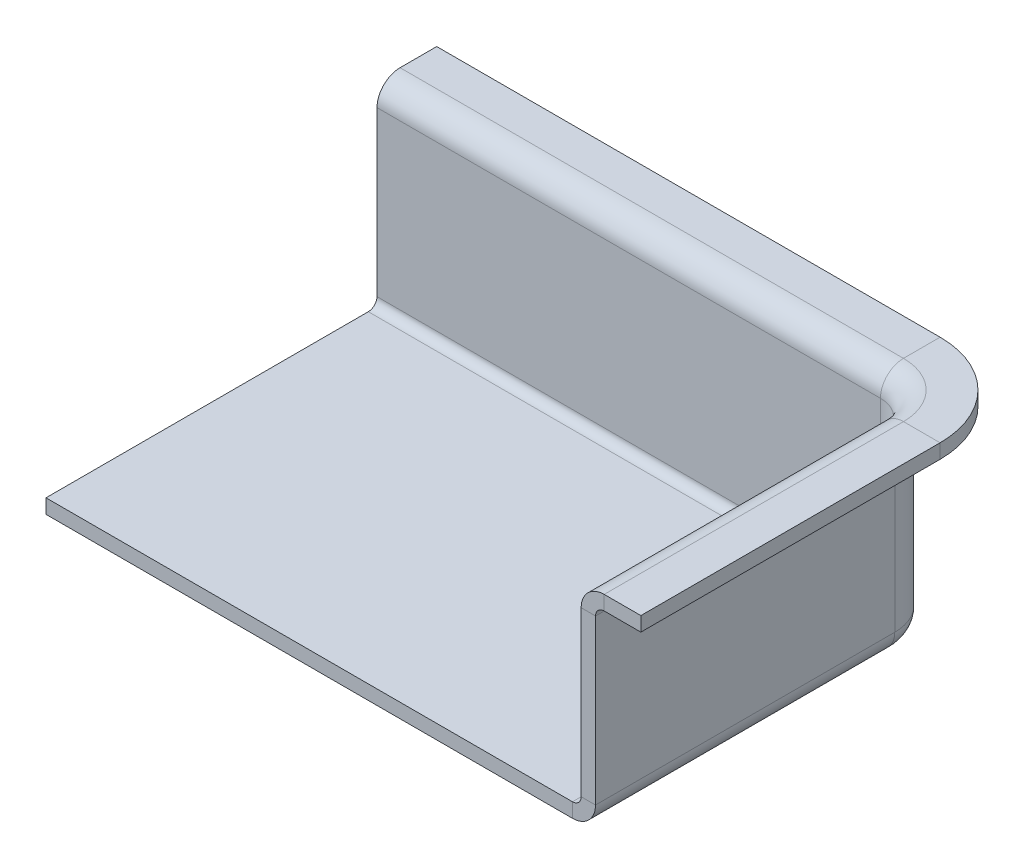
ISO-10303-21;
HEADER;
FILE_DESCRIPTION(('STEP AP214'),'2;1');
FILE_NAME('part.step','',(''),(''),'','','');
FILE_SCHEMA(('AUTOMOTIVE_DESIGN { 1 0 10303 214 1 1 1 1 }'));
ENDSEC;
DATA;
#1=APPLICATION_CONTEXT('core data for automotive mechanical design processes');
#2=APPLICATION_PROTOCOL_DEFINITION('international standard','automotive_design',2000,#1);
#3=PRODUCT_CONTEXT('',#1,'mechanical');
#4=PRODUCT('Part','Part','',(#3));
#5=PRODUCT_RELATED_PRODUCT_CATEGORY('part','',(#4));
#6=PRODUCT_DEFINITION_FORMATION('','',#4);
#7=PRODUCT_DEFINITION_CONTEXT('part definition',#1,'design');
#8=PRODUCT_DEFINITION('design','',#6,#7);
#9=PRODUCT_DEFINITION_SHAPE('','',#8);
#10=(LENGTH_UNIT() NAMED_UNIT(*) SI_UNIT(.MILLI.,.METRE.));
#11=(NAMED_UNIT(*) PLANE_ANGLE_UNIT() SI_UNIT($,.RADIAN.));
#12=(NAMED_UNIT(*) SI_UNIT($,.STERADIAN.) SOLID_ANGLE_UNIT());
#13=UNCERTAINTY_MEASURE_WITH_UNIT(LENGTH_MEASURE(1.E-05),#10,'distance_accuracy_value','');
#14=(GEOMETRIC_REPRESENTATION_CONTEXT(3) GLOBAL_UNCERTAINTY_ASSIGNED_CONTEXT((#13)) GLOBAL_UNIT_ASSIGNED_CONTEXT((#10,
#11,#12)) REPRESENTATION_CONTEXT('',''));
#15=CARTESIAN_POINT('',(0.,0.,0.));
#16=DIRECTION('',(0.,0.,1.));
#17=DIRECTION('',(1.,0.,0.));
#18=AXIS2_PLACEMENT_3D('',#15,#16,#17);
#19=CARTESIAN_POINT('',(-64.6141456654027,-3.302,-37.9563970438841));
#20=DIRECTION('',(-1.,0.,0.));
#21=DIRECTION('',(0.,0.,1.));
#22=AXIS2_PLACEMENT_3D('',#19,#20,#21);
#23=PLANE('',#22);
#24=DIRECTION('',(0.,0.,1.));
#25=VECTOR('',#24,1.);
#26=CARTESIAN_POINT('',(-64.6141456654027,0.,-37.9563970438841));
#27=LINE('',#26,#25);
#28=CARTESIAN_POINT('',(-64.6141456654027,0.,-32.6543970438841));
#29=VERTEX_POINT('',#28);
#30=CARTESIAN_POINT('',(-64.6141456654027,0.,41.4872246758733));
#31=VERTEX_POINT('',#30);
#32=EDGE_CURVE('E393',#29,#31,#27,.T.);
#33=ORIENTED_EDGE('',*,*,#32,.F.);
#34=DIRECTION('',(0.,1.,0.));
#35=VECTOR('',#34,1.);
#36=CARTESIAN_POINT('',(-64.6141456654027,-3.302,-32.6543970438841));
#37=LINE('',#36,#35);
#38=CARTESIAN_POINT('',(-64.6141456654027,-3.302,-32.6543970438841));
#39=VERTEX_POINT('',#38);
#40=EDGE_CURVE('E385',#39,#29,#37,.T.);
#41=ORIENTED_EDGE('',*,*,#40,.F.);
#42=DIRECTION('',(0.,0.,1.));
#43=VECTOR('',#42,1.);
#44=CARTESIAN_POINT('',(-64.6141456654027,-3.302,-37.9563970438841));
#45=LINE('',#44,#43);
#46=CARTESIAN_POINT('',(-64.6141456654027,-3.302,41.4872246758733));
#47=VERTEX_POINT('',#46);
#48=EDGE_CURVE('E57',#39,#47,#45,.T.);
#49=ORIENTED_EDGE('',*,*,#48,.T.);
#50=DIRECTION('',(0.,1.,0.));
#51=VECTOR('',#50,1.);
#52=CARTESIAN_POINT('',(-64.6141456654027,-3.302,41.4872246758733));
#53=LINE('',#52,#51);
#54=EDGE_CURVE('E12',#47,#31,#53,.T.);
#55=ORIENTED_EDGE('',*,*,#54,.T.);
#56=EDGE_LOOP('',(#33,#41,#49,#55));
#57=FACE_BOUND('',#56,.T.);
#58=ADVANCED_FACE('F35',(#57),#23,.T.);
#59=CARTESIAN_POINT('',(-64.6141456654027,-3.302,41.4872246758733));
#60=DIRECTION('',(0.,0.,1.));
#61=DIRECTION('',(1.,0.,0.));
#62=AXIS2_PLACEMENT_3D('',#59,#60,#61);
#63=PLANE('',#62);
#64=DIRECTION('',(0.,1.,0.));
#65=VECTOR('',#64,1.);
#66=CARTESIAN_POINT('',(56.4874835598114,-3.302,41.4872246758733));
#67=LINE('',#66,#65);
#68=CARTESIAN_POINT('',(56.4874835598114,-3.302,41.4872246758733));
#69=VERTEX_POINT('',#68);
#70=CARTESIAN_POINT('',(56.4874835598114,0.,41.4872246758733));
#71=VERTEX_POINT('',#70);
#72=EDGE_CURVE('E382',#69,#71,#67,.T.);
#73=ORIENTED_EDGE('',*,*,#72,.T.);
#74=DIRECTION('',(1.,0.,0.));
#75=VECTOR('',#74,1.);
#76=CARTESIAN_POINT('',(-64.6141456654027,0.,41.4872246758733));
#77=LINE('',#76,#75);
#78=EDGE_CURVE('E396',#31,#71,#77,.T.);
#79=ORIENTED_EDGE('',*,*,#78,.F.);
#80=ORIENTED_EDGE('',*,*,#54,.F.);
#81=DIRECTION('',(1.,0.,0.));
#82=VECTOR('',#81,1.);
#83=CARTESIAN_POINT('',(-64.6141456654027,-3.302,41.4872246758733));
#84=LINE('',#83,#82);
#85=EDGE_CURVE('E42',#47,#69,#84,.T.);
#86=ORIENTED_EDGE('',*,*,#85,.T.);
#87=EDGE_LOOP('',(#73,#79,#80,#86));
#88=FACE_BOUND('',#87,.T.);
#89=ADVANCED_FACE('F405',(#88),#63,.T.);
#90=CARTESIAN_POINT('',(0.,-3.302,0.));
#91=DIRECTION('',(0.,1.,0.));
#92=DIRECTION('',(0.,0.,1.));
#93=AXIS2_PLACEMENT_3D('',#90,#91,#92);
#94=PLANE('',#93);
#95=CARTESIAN_POINT('',(51.1854835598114,-3.302,-27.3523970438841));
#96=DIRECTION('',(0.,1.,0.));
#97=DIRECTION('',(1.,0.,0.));
#98=AXIS2_PLACEMENT_3D('',#95,#96,#97);
#99=CIRCLE('',#98,5.302);
#100=CARTESIAN_POINT('',(56.4874835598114,-3.302,-27.3523970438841));
#101=VERTEX_POINT('',#100);
#102=CARTESIAN_POINT('',(51.1854835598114,-3.302,-32.6543970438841));
#103=VERTEX_POINT('',#102);
#104=EDGE_CURVE('E303',#101,#103,#99,.T.);
#105=ORIENTED_EDGE('',*,*,#104,.F.);
#106=DIRECTION('',(0.,0.,-1.));
#107=VECTOR('',#106,1.);
#108=CARTESIAN_POINT('',(56.4874835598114,-3.302,41.4872246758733));
#109=LINE('',#108,#107);
#110=EDGE_CURVE('E293',#69,#101,#109,.T.);
#111=ORIENTED_EDGE('',*,*,#110,.F.);
#112=ORIENTED_EDGE('',*,*,#85,.F.);
#113=ORIENTED_EDGE('',*,*,#48,.F.);
#114=DIRECTION('',(-1.,0.,0.));
#115=VECTOR('',#114,1.);
#116=CARTESIAN_POINT('',(51.1854835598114,-3.302,-32.6543970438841));
#117=LINE('',#116,#115);
#118=EDGE_CURVE('E313',#103,#39,#117,.T.);
#119=ORIENTED_EDGE('',*,*,#118,.F.);
#120=EDGE_LOOP('',(#105,#111,#112,#113,#119));
#121=FACE_BOUND('',#120,.T.);
#122=ADVANCED_FACE('F418',(#121),#94,.F.);
#123=CARTESIAN_POINT('',(0.,0.,0.));
#124=DIRECTION('',(0.,1.,0.));
#125=DIRECTION('',(0.,0.,1.));
#126=AXIS2_PLACEMENT_3D('',#123,#124,#125);
#127=PLANE('',#126);
#128=DIRECTION('',(0.,0.,-1.));
#129=VECTOR('',#128,1.);
#130=CARTESIAN_POINT('',(56.4874835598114,0.,41.4872246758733));
#131=LINE('',#130,#129);
#132=CARTESIAN_POINT('',(56.4874835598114,0.,-27.3523970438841));
#133=VERTEX_POINT('',#132);
#134=EDGE_CURVE('E252',#71,#133,#131,.T.);
#135=ORIENTED_EDGE('',*,*,#134,.T.);
#136=CARTESIAN_POINT('',(51.1854835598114,0.,-27.3523970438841));
#137=DIRECTION('',(0.,1.,0.));
#138=DIRECTION('',(0.,0.,1.));
#139=AXIS2_PLACEMENT_3D('',#136,#137,#138);
#140=CIRCLE('',#139,5.302);
#141=CARTESIAN_POINT('',(51.1854835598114,0.,-32.6543970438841));
#142=VERTEX_POINT('',#141);
#143=EDGE_CURVE('E232',#133,#142,#140,.T.);
#144=ORIENTED_EDGE('',*,*,#143,.T.);
#145=DIRECTION('',(-1.,0.,0.));
#146=VECTOR('',#145,1.);
#147=CARTESIAN_POINT('',(51.1854835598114,0.,-32.6543970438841));
#148=LINE('',#147,#146);
#149=EDGE_CURVE('E257',#142,#29,#148,.T.);
#150=ORIENTED_EDGE('',*,*,#149,.T.);
#151=ORIENTED_EDGE('',*,*,#32,.T.);
#152=ORIENTED_EDGE('',*,*,#78,.T.);
#153=EDGE_LOOP('',(#135,#144,#150,#151,#152));
#154=FACE_BOUND('',#153,.T.);
#155=ADVANCED_FACE('F402',(#154),#127,.T.);
#156=CARTESIAN_POINT('',(-64.6141456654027,39.65704961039,-39.9563970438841));
#157=DIRECTION('',(-1.,0.,0.));
#158=DIRECTION('',(0.,0.,1.));
#159=AXIS2_PLACEMENT_3D('',#156,#157,#158);
#160=PLANE('',#159);
#161=DIRECTION('',(0.,1.,0.));
#162=VECTOR('',#161,1.);
#163=CARTESIAN_POINT('',(-64.6141456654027,41.65704961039,-39.9563970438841));
#164=LINE('',#163,#162);
#165=CARTESIAN_POINT('',(-64.6141456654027,41.65704961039,-39.9563970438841));
#166=VERTEX_POINT('',#165);
#167=CARTESIAN_POINT('',(-64.6141456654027,44.95904961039,-39.9563970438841));
#168=VERTEX_POINT('',#167);
#169=EDGE_CURVE('E391',#166,#168,#164,.T.);
#170=ORIENTED_EDGE('',*,*,#169,.F.);
#171=CARTESIAN_POINT('',(-64.6141456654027,39.65704961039,-39.9563970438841));
#172=DIRECTION('',(1.,0.,0.));
#173=DIRECTION('',(0.,0.,-1.));
#174=AXIS2_PLACEMENT_3D('',#171,#172,#173);
#175=CIRCLE('',#174,2.);
#176=CARTESIAN_POINT('',(-64.6141456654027,39.65704961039,-37.9563970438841));
#177=VERTEX_POINT('',#176);
#178=EDGE_CURVE('E337',#177,#166,#175,.F.);
#179=ORIENTED_EDGE('',*,*,#178,.F.);
#180=DIRECTION('',(0.,0.,1.));
#181=VECTOR('',#180,1.);
#182=CARTESIAN_POINT('',(-64.6141456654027,39.65704961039,-37.9563970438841));
#183=LINE('',#182,#181);
#184=CARTESIAN_POINT('',(-64.6141456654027,39.65704961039,-34.6543970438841));
#185=VERTEX_POINT('',#184);
#186=EDGE_CURVE('E389',#177,#185,#183,.T.);
#187=ORIENTED_EDGE('',*,*,#186,.T.);
#188=CARTESIAN_POINT('',(-64.6141456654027,39.65704961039,-39.9563970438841));
#189=DIRECTION('',(-1.,0.,0.));
#190=DIRECTION('',(0.,0.,1.));
#191=AXIS2_PLACEMENT_3D('',#188,#189,#190);
#192=CIRCLE('',#191,5.302);
#193=EDGE_CURVE('E191',#185,#168,#192,.T.);
#194=ORIENTED_EDGE('',*,*,#193,.T.);
#195=EDGE_LOOP('',(#170,#179,#187,#194));
#196=FACE_BOUND('',#195,.T.);
#197=ADVANCED_FACE('F490',(#196),#160,.T.);
#198=CARTESIAN_POINT('',(-64.6141456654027,-3.302,-37.9563970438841));
#199=DIRECTION('',(1.,0.,0.));
#200=DIRECTION('',(0.,1.,0.));
#201=AXIS2_PLACEMENT_3D('',#198,#199,#200);
#202=PLANE('',#201);
#203=ORIENTED_EDGE('',*,*,#186,.F.);
#204=DIRECTION('',(0.,1.,0.));
#205=VECTOR('',#204,1.);
#206=CARTESIAN_POINT('',(-64.6141456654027,-3.302,-37.9563970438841));
#207=LINE('',#206,#205);
#208=CARTESIAN_POINT('',(-64.6141456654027,2.,-37.9563970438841));
#209=VERTEX_POINT('',#208);
#210=EDGE_CURVE('E316',#209,#177,#207,.T.);
#211=ORIENTED_EDGE('',*,*,#210,.F.);
#212=DIRECTION('',(0.,0.,1.));
#213=VECTOR('',#212,1.);
#214=CARTESIAN_POINT('',(-64.6141456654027,2.,-37.9563970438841));
#215=LINE('',#214,#213);
#216=CARTESIAN_POINT('',(-64.6141456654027,2.,-34.6543970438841));
#217=VERTEX_POINT('',#216);
#218=EDGE_CURVE('E387',#209,#217,#215,.T.);
#219=ORIENTED_EDGE('',*,*,#218,.T.);
#220=DIRECTION('',(0.,1.,0.));
#221=VECTOR('',#220,1.);
#222=CARTESIAN_POINT('',(-64.6141456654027,-3.302,-34.6543970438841));
#223=LINE('',#222,#221);
#224=EDGE_CURVE('E225',#217,#185,#223,.T.);
#225=ORIENTED_EDGE('',*,*,#224,.T.);
#226=EDGE_LOOP('',(#203,#211,#219,#225));
#227=FACE_BOUND('',#226,.T.);
#228=ADVANCED_FACE('F492',(#227),#202,.F.);
#229=CARTESIAN_POINT('',(-64.6141456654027,2.,-32.6543970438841));
#230=DIRECTION('',(1.,0.,0.));
#231=DIRECTION('',(0.,0.,-1.));
#232=AXIS2_PLACEMENT_3D('',#229,#230,#231);
#233=PLANE('',#232);
#234=ORIENTED_EDGE('',*,*,#218,.F.);
#235=CARTESIAN_POINT('',(-64.6141456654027,2.,-32.6543970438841));
#236=DIRECTION('',(-1.,0.,0.));
#237=DIRECTION('',(0.,0.,1.));
#238=AXIS2_PLACEMENT_3D('',#235,#236,#237);
#239=CIRCLE('',#238,5.302);
#240=EDGE_CURVE('E309',#39,#209,#239,.F.);
#241=ORIENTED_EDGE('',*,*,#240,.F.);
#242=ORIENTED_EDGE('',*,*,#40,.T.);
#243=CARTESIAN_POINT('',(-64.6141456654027,2.,-32.6543970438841));
#244=DIRECTION('',(-1.,0.,0.));
#245=DIRECTION('',(0.,0.,1.));
#246=AXIS2_PLACEMENT_3D('',#243,#244,#245);
#247=CIRCLE('',#246,2.);
#248=EDGE_CURVE('E226',#29,#217,#247,.F.);
#249=ORIENTED_EDGE('',*,*,#248,.T.);
#250=EDGE_LOOP('',(#234,#241,#242,#249));
#251=FACE_BOUND('',#250,.T.);
#252=ADVANCED_FACE('F447',(#251),#233,.F.);
#253=CARTESIAN_POINT('',(56.4874835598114,2.,41.4872246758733));
#254=DIRECTION('',(0.,0.,1.));
#255=DIRECTION('',(1.,0.,0.));
#256=AXIS2_PLACEMENT_3D('',#253,#254,#255);
#257=PLANE('',#256);
#258=ORIENTED_EDGE('',*,*,#72,.F.);
#259=CARTESIAN_POINT('',(56.4874835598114,2.,41.4872246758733));
#260=DIRECTION('',(0.,0.,-1.));
#261=DIRECTION('',(-1.,0.,0.));
#262=AXIS2_PLACEMENT_3D('',#259,#260,#261);
#263=CIRCLE('',#262,5.302);
#264=CARTESIAN_POINT('',(61.7894835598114,2.,41.4872246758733));
#265=VERTEX_POINT('',#264);
#266=EDGE_CURVE('E285',#69,#265,#263,.F.);
#267=ORIENTED_EDGE('',*,*,#266,.T.);
#268=DIRECTION('',(-1.,0.,0.));
#269=VECTOR('',#268,1.);
#270=CARTESIAN_POINT('',(61.7894835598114,2.,41.4872246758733));
#271=LINE('',#270,#269);
#272=CARTESIAN_POINT('',(58.4874835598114,2.,41.4872246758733));
#273=VERTEX_POINT('',#272);
#274=EDGE_CURVE('E380',#265,#273,#271,.T.);
#275=ORIENTED_EDGE('',*,*,#274,.T.);
#276=CARTESIAN_POINT('',(56.4874835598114,2.,41.4872246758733));
#277=DIRECTION('',(0.,0.,-1.));
#278=DIRECTION('',(-1.,0.,0.));
#279=AXIS2_PLACEMENT_3D('',#276,#277,#278);
#280=CIRCLE('',#279,2.);
#281=EDGE_CURVE('E269',#71,#273,#280,.F.);
#282=ORIENTED_EDGE('',*,*,#281,.F.);
#283=EDGE_LOOP('',(#258,#267,#275,#282));
#284=FACE_BOUND('',#283,.T.);
#285=ADVANCED_FACE('F410',(#284),#257,.T.);
#286=CARTESIAN_POINT('',(61.7894835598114,-3.302,41.4872246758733));
#287=DIRECTION('',(0.,0.,1.));
#288=DIRECTION('',(0.,1.,0.));
#289=AXIS2_PLACEMENT_3D('',#286,#287,#288);
#290=PLANE('',#289);
#291=ORIENTED_EDGE('',*,*,#274,.F.);
#292=DIRECTION('',(0.,1.,0.));
#293=VECTOR('',#292,1.);
#294=CARTESIAN_POINT('',(61.7894835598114,-3.302,41.4872246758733));
#295=LINE('',#294,#293);
#296=CARTESIAN_POINT('',(61.7894835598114,39.65704961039,41.4872246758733));
#297=VERTEX_POINT('',#296);
#298=EDGE_CURVE('E288',#265,#297,#295,.T.);
#299=ORIENTED_EDGE('',*,*,#298,.T.);
#300=DIRECTION('',(-1.,0.,0.));
#301=VECTOR('',#300,1.);
#302=CARTESIAN_POINT('',(61.7894835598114,39.65704961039,41.4872246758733));
#303=LINE('',#302,#301);
#304=CARTESIAN_POINT('',(58.4874835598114,39.65704961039,41.4872246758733));
#305=VERTEX_POINT('',#304);
#306=EDGE_CURVE('E378',#297,#305,#303,.T.);
#307=ORIENTED_EDGE('',*,*,#306,.T.);
#308=DIRECTION('',(0.,1.,0.));
#309=VECTOR('',#308,1.);
#310=CARTESIAN_POINT('',(58.4874835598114,-3.302,41.4872246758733));
#311=LINE('',#310,#309);
#312=EDGE_CURVE('E266',#273,#305,#311,.T.);
#313=ORIENTED_EDGE('',*,*,#312,.F.);
#314=EDGE_LOOP('',(#291,#299,#307,#313));
#315=FACE_BOUND('',#314,.T.);
#316=ADVANCED_FACE('F434',(#315),#290,.T.);
#317=CARTESIAN_POINT('',(63.7894835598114,39.65704961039,41.4872246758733));
#318=DIRECTION('',(0.,0.,-1.));
#319=DIRECTION('',(-1.,0.,0.));
#320=AXIS2_PLACEMENT_3D('',#317,#318,#319);
#321=PLANE('',#320);
#322=ORIENTED_EDGE('',*,*,#306,.F.);
#323=CARTESIAN_POINT('',(63.7894835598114,39.65704961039,41.4872246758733));
#324=DIRECTION('',(0.,0.,1.));
#325=DIRECTION('',(1.,0.,0.));
#326=AXIS2_PLACEMENT_3D('',#323,#324,#325);
#327=CIRCLE('',#326,2.);
#328=CARTESIAN_POINT('',(63.7894835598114,41.65704961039,41.4872246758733));
#329=VERTEX_POINT('',#328);
#330=EDGE_CURVE('E321',#297,#329,#327,.F.);
#331=ORIENTED_EDGE('',*,*,#330,.T.);
#332=DIRECTION('',(0.,1.,0.));
#333=VECTOR('',#332,1.);
#334=CARTESIAN_POINT('',(63.7894835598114,41.65704961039,41.4872246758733));
#335=LINE('',#334,#333);
#336=CARTESIAN_POINT('',(63.7894835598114,44.95904961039,41.4872246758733));
#337=VERTEX_POINT('',#336);
#338=EDGE_CURVE('E376',#329,#337,#335,.T.);
#339=ORIENTED_EDGE('',*,*,#338,.T.);
#340=CARTESIAN_POINT('',(63.7894835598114,39.65704961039,41.4872246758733));
#341=DIRECTION('',(0.,0.,-1.));
#342=DIRECTION('',(-1.,0.,0.));
#343=AXIS2_PLACEMENT_3D('',#340,#341,#342);
#344=CIRCLE('',#343,5.302);
#345=EDGE_CURVE('E263',#305,#337,#344,.T.);
#346=ORIENTED_EDGE('',*,*,#345,.F.);
#347=EDGE_LOOP('',(#322,#331,#339,#346));
#348=FACE_BOUND('',#347,.T.);
#349=ADVANCED_FACE('F462',(#348),#321,.F.);
#350=CARTESIAN_POINT('',(61.7894835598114,41.65704961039,41.4872246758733));
#351=DIRECTION('',(0.,0.,1.));
#352=DIRECTION('',(1.,0.,0.));
#353=AXIS2_PLACEMENT_3D('',#350,#351,#352);
#354=PLANE('',#353);
#355=ORIENTED_EDGE('',*,*,#338,.F.);
#356=DIRECTION('',(1.,0.,0.));
#357=VECTOR('',#356,1.);
#358=CARTESIAN_POINT('',(61.7894835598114,41.65704961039,41.4872246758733));
#359=LINE('',#358,#357);
#360=CARTESIAN_POINT('',(72.2210418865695,41.65704961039,41.4872246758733));
#361=VERTEX_POINT('',#360);
#362=EDGE_CURVE('E298',#329,#361,#359,.T.);
#363=ORIENTED_EDGE('',*,*,#362,.T.);
#364=DIRECTION('',(0.,1.,0.));
#365=VECTOR('',#364,1.);
#366=CARTESIAN_POINT('',(72.2210418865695,41.65704961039,41.4872246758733));
#367=LINE('',#366,#365);
#368=CARTESIAN_POINT('',(72.2210418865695,44.95904961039,41.4872246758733));
#369=VERTEX_POINT('',#368);
#370=EDGE_CURVE('E374',#361,#369,#367,.T.);
#371=ORIENTED_EDGE('',*,*,#370,.T.);
#372=DIRECTION('',(1.,0.,0.));
#373=VECTOR('',#372,1.);
#374=CARTESIAN_POINT('',(61.7894835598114,44.95904961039,41.4872246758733));
#375=LINE('',#374,#373);
#376=EDGE_CURVE('E260',#337,#369,#375,.T.);
#377=ORIENTED_EDGE('',*,*,#376,.F.);
#378=EDGE_LOOP('',(#355,#363,#371,#377));
#379=FACE_BOUND('',#378,.T.);
#380=ADVANCED_FACE('F465',(#379),#354,.T.);
#381=CARTESIAN_POINT('',(72.2210418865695,41.65704961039,41.4872246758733));
#382=DIRECTION('',(1.,0.,0.));
#383=DIRECTION('',(0.,0.,-1.));
#384=AXIS2_PLACEMENT_3D('',#381,#382,#383);
#385=PLANE('',#384);
#386=ORIENTED_EDGE('',*,*,#370,.F.);
#387=DIRECTION('',(0.,0.,-1.));
#388=VECTOR('',#387,1.);
#389=CARTESIAN_POINT('',(72.2210418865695,41.65704961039,41.4872246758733));
#390=LINE('',#389,#388);
#391=CARTESIAN_POINT('',(72.2210418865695,41.65704961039,-27.3523970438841));
#392=VERTEX_POINT('',#391);
#393=EDGE_CURVE('E308',#361,#392,#390,.T.);
#394=ORIENTED_EDGE('',*,*,#393,.T.);
#395=DIRECTION('',(0.,1.,0.));
#396=VECTOR('',#395,1.);
#397=CARTESIAN_POINT('',(72.2210418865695,41.65704961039,-27.3523970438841));
#398=LINE('',#397,#396);
#399=CARTESIAN_POINT('',(72.2210418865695,44.95904961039,-27.3523970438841));
#400=VERTEX_POINT('',#399);
#401=EDGE_CURVE('E372',#392,#400,#398,.T.);
#402=ORIENTED_EDGE('',*,*,#401,.T.);
#403=DIRECTION('',(0.,0.,1.));
#404=VECTOR('',#403,1.);
#405=CARTESIAN_POINT('',(72.2210418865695,44.95904961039,41.4872246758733));
#406=LINE('',#405,#404);
#407=EDGE_CURVE('E245',#369,#400,#406,.F.);
#408=ORIENTED_EDGE('',*,*,#407,.F.);
#409=EDGE_LOOP('',(#386,#394,#402,#408));
#410=FACE_BOUND('',#409,.T.);
#411=ADVANCED_FACE('F539',(#410),#385,.T.);
#412=CARTESIAN_POINT('',(51.1854835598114,41.65704961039,-27.3523970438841));
#413=DIRECTION('',(0.,1.,0.));
#414=DIRECTION('',(0.,0.,1.));
#415=AXIS2_PLACEMENT_3D('',#412,#413,#414);
#416=CYLINDRICAL_SURFACE('',#415,21.0355583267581);
#417=ORIENTED_EDGE('',*,*,#401,.F.);
#418=CARTESIAN_POINT('',(51.1854835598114,41.65704961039,-27.3523970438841));
#419=DIRECTION('',(0.,1.,0.));
#420=DIRECTION('',(1.,0.,0.));
#421=AXIS2_PLACEMENT_3D('',#418,#419,#420);
#422=CIRCLE('',#421,21.0355583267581);
#423=CARTESIAN_POINT('',(51.1854835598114,41.65704961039,-48.3879553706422));
#424=VERTEX_POINT('',#423);
#425=EDGE_CURVE('E318',#392,#424,#422,.T.);
#426=ORIENTED_EDGE('',*,*,#425,.T.);
#427=DIRECTION('',(0.,1.,0.));
#428=VECTOR('',#427,1.);
#429=CARTESIAN_POINT('',(51.1854835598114,41.65704961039,-48.3879553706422));
#430=LINE('',#429,#428);
#431=CARTESIAN_POINT('',(51.1854835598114,44.95904961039,-48.3879553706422));
#432=VERTEX_POINT('',#431);
#433=EDGE_CURVE('E370',#424,#432,#430,.T.);
#434=ORIENTED_EDGE('',*,*,#433,.T.);
#435=CARTESIAN_POINT('',(51.1854835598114,44.95904961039,-27.3523970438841));
#436=DIRECTION('',(0.,1.,0.));
#437=DIRECTION('',(0.,0.,1.));
#438=AXIS2_PLACEMENT_3D('',#435,#436,#437);
#439=CIRCLE('',#438,21.0355583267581);
#440=EDGE_CURVE('E201',#400,#432,#439,.T.);
#441=ORIENTED_EDGE('',*,*,#440,.F.);
#442=EDGE_LOOP('',(#417,#426,#434,#441));
#443=FACE_BOUND('',#442,.T.);
#444=ADVANCED_FACE('F472',(#443),#416,.T.);
#445=CARTESIAN_POINT('',(51.1854835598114,41.65704961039,-48.3879553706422));
#446=DIRECTION('',(0.,0.,-1.));
#447=DIRECTION('',(-1.,0.,0.));
#448=AXIS2_PLACEMENT_3D('',#445,#446,#447);
#449=PLANE('',#448);
#450=ORIENTED_EDGE('',*,*,#433,.F.);
#451=DIRECTION('',(-1.,0.,0.));
#452=VECTOR('',#451,1.);
#453=CARTESIAN_POINT('',(51.1854835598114,41.65704961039,-48.3879553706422));
#454=LINE('',#453,#452);
#455=CARTESIAN_POINT('',(-64.6141456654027,41.65704961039,-48.3879553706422));
#456=VERTEX_POINT('',#455);
#457=EDGE_CURVE('E272',#424,#456,#454,.T.);
#458=ORIENTED_EDGE('',*,*,#457,.T.);
#459=DIRECTION('',(0.,1.,0.));
#460=VECTOR('',#459,1.);
#461=CARTESIAN_POINT('',(-64.6141456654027,41.65704961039,-48.3879553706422));
#462=LINE('',#461,#460);
#463=CARTESIAN_POINT('',(-64.6141456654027,44.95904961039,-48.3879553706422));
#464=VERTEX_POINT('',#463);
#465=EDGE_CURVE('E255',#456,#464,#462,.T.);
#466=ORIENTED_EDGE('',*,*,#465,.T.);
#467=DIRECTION('',(1.,0.,0.));
#468=VECTOR('',#467,1.);
#469=CARTESIAN_POINT('',(51.1854835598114,44.95904961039,-48.3879553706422));
#470=LINE('',#469,#468);
#471=EDGE_CURVE('E253',#432,#464,#470,.F.);
#472=ORIENTED_EDGE('',*,*,#471,.F.);
#473=EDGE_LOOP('',(#450,#458,#466,#472));
#474=FACE_BOUND('',#473,.T.);
#475=ADVANCED_FACE('F476',(#474),#449,.T.);
#476=CARTESIAN_POINT('',(-64.6141456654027,41.65704961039,-37.9563970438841));
#477=DIRECTION('',(1.,0.,0.));
#478=DIRECTION('',(0.,0.,-1.));
#479=AXIS2_PLACEMENT_3D('',#476,#477,#478);
#480=PLANE('',#479);
#481=DIRECTION('',(0.,0.,-1.));
#482=VECTOR('',#481,1.);
#483=CARTESIAN_POINT('',(-64.6141456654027,41.65704961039,-37.9563970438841));
#484=LINE('',#483,#482);
#485=EDGE_CURVE('E355',#166,#456,#484,.T.);
#486=ORIENTED_EDGE('',*,*,#485,.F.);
#487=ORIENTED_EDGE('',*,*,#169,.T.);
#488=DIRECTION('',(0.,0.,1.));
#489=VECTOR('',#488,1.);
#490=CARTESIAN_POINT('',(-64.6141456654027,44.95904961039,-37.9563970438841));
#491=LINE('',#490,#489);
#492=EDGE_CURVE('E186',#168,#464,#491,.F.);
#493=ORIENTED_EDGE('',*,*,#492,.T.);
#494=ORIENTED_EDGE('',*,*,#465,.F.);
#495=EDGE_LOOP('',(#486,#487,#493,#494));
#496=FACE_BOUND('',#495,.T.);
#497=ADVANCED_FACE('F487',(#496),#480,.F.);
#498=CARTESIAN_POINT('',(51.1854835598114,44.95904961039,-37.9563970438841));
#499=DIRECTION('',(0.,1.,0.));
#500=DIRECTION('',(0.,0.,1.));
#501=AXIS2_PLACEMENT_3D('',#498,#499,#500);
#502=PLANE('',#501);
#503=ORIENTED_EDGE('',*,*,#471,.T.);
#504=ORIENTED_EDGE('',*,*,#492,.F.);
#505=DIRECTION('',(-1.,0.,0.));
#506=VECTOR('',#505,1.);
#507=CARTESIAN_POINT('',(51.1854835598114,44.95904961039,-39.9563970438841));
#508=LINE('',#507,#506);
#509=CARTESIAN_POINT('',(51.1854835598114,44.95904961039,-39.9563970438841));
#510=VERTEX_POINT('',#509);
#511=EDGE_CURVE('E180',#510,#168,#508,.T.);
#512=ORIENTED_EDGE('',*,*,#511,.F.);
#513=DIRECTION('',(0.,0.,1.));
#514=VECTOR('',#513,1.);
#515=CARTESIAN_POINT('',(51.1854835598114,44.95904961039,-37.9563970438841));
#516=LINE('',#515,#514);
#517=EDGE_CURVE('E184',#510,#432,#516,.F.);
#518=ORIENTED_EDGE('',*,*,#517,.T.);
#519=EDGE_LOOP('',(#503,#504,#512,#518));
#520=FACE_BOUND('',#519,.T.);
#521=ADVANCED_FACE('F183',(#520),#502,.T.);
#522=CARTESIAN_POINT('',(51.1854835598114,39.65704961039,-39.9563970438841));
#523=DIRECTION('',(-1.,0.,0.));
#524=DIRECTION('',(0.,0.,1.));
#525=AXIS2_PLACEMENT_3D('',#522,#523,#524);
#526=CYLINDRICAL_SURFACE('',#525,5.302);
#527=ORIENTED_EDGE('',*,*,#511,.T.);
#528=ORIENTED_EDGE('',*,*,#193,.F.);
#529=DIRECTION('',(1.,0.,0.));
#530=VECTOR('',#529,1.);
#531=CARTESIAN_POINT('',(51.1854835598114,39.65704961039,-34.6543970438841));
#532=LINE('',#531,#530);
#533=CARTESIAN_POINT('',(51.1854835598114,39.65704961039,-34.6543970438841));
#534=VERTEX_POINT('',#533);
#535=EDGE_CURVE('E215',#534,#185,#532,.F.);
#536=ORIENTED_EDGE('',*,*,#535,.F.);
#537=CARTESIAN_POINT('',(51.1854835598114,39.65704961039,-39.9563970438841));
#538=DIRECTION('',(-1.,0.,0.));
#539=DIRECTION('',(0.,0.,1.));
#540=AXIS2_PLACEMENT_3D('',#537,#538,#539);
#541=CIRCLE('',#540,5.302);
#542=EDGE_CURVE('E208',#534,#510,#541,.T.);
#543=ORIENTED_EDGE('',*,*,#542,.T.);
#544=EDGE_LOOP('',(#527,#528,#536,#543));
#545=FACE_BOUND('',#544,.T.);
#546=ADVANCED_FACE('F213',(#545),#526,.T.);
#547=CARTESIAN_POINT('',(51.1854835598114,-3.302,-34.6543970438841));
#548=DIRECTION('',(0.,0.,1.));
#549=DIRECTION('',(1.,0.,0.));
#550=AXIS2_PLACEMENT_3D('',#547,#548,#549);
#551=PLANE('',#550);
#552=ORIENTED_EDGE('',*,*,#535,.T.);
#553=ORIENTED_EDGE('',*,*,#224,.F.);
#554=DIRECTION('',(-1.,0.,0.));
#555=VECTOR('',#554,1.);
#556=CARTESIAN_POINT('',(51.1854835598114,2.,-34.6543970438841));
#557=LINE('',#556,#555);
#558=CARTESIAN_POINT('',(51.1854835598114,2.,-34.6543970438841));
#559=VERTEX_POINT('',#558);
#560=EDGE_CURVE('E222',#559,#217,#557,.T.);
#561=ORIENTED_EDGE('',*,*,#560,.F.);
#562=DIRECTION('',(0.,1.,0.));
#563=VECTOR('',#562,1.);
#564=CARTESIAN_POINT('',(51.1854835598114,-3.302,-34.6543970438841));
#565=LINE('',#564,#563);
#566=EDGE_CURVE('E218',#559,#534,#565,.T.);
#567=ORIENTED_EDGE('',*,*,#566,.T.);
#568=EDGE_LOOP('',(#552,#553,#561,#567));
#569=FACE_BOUND('',#568,.T.);
#570=ADVANCED_FACE('F452',(#569),#551,.T.);
#571=CARTESIAN_POINT('',(51.1854835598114,2.,-32.6543970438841));
#572=DIRECTION('',(-1.,0.,0.));
#573=DIRECTION('',(0.,0.,1.));
#574=AXIS2_PLACEMENT_3D('',#571,#572,#573);
#575=CYLINDRICAL_SURFACE('',#574,2.);
#576=ORIENTED_EDGE('',*,*,#560,.T.);
#577=ORIENTED_EDGE('',*,*,#248,.F.);
#578=ORIENTED_EDGE('',*,*,#149,.F.);
#579=CARTESIAN_POINT('',(51.1854835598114,2.,-32.6543970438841));
#580=DIRECTION('',(-1.,0.,0.));
#581=DIRECTION('',(0.,0.,1.));
#582=AXIS2_PLACEMENT_3D('',#579,#580,#581);
#583=CIRCLE('',#582,2.);
#584=EDGE_CURVE('E230',#142,#559,#583,.F.);
#585=ORIENTED_EDGE('',*,*,#584,.T.);
#586=EDGE_LOOP('',(#576,#577,#578,#585));
#587=FACE_BOUND('',#586,.T.);
#588=ADVANCED_FACE('F448',(#587),#575,.F.);
#589=CARTESIAN_POINT('',(61.7894835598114,44.95904961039,-27.3523970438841));
#590=DIRECTION('',(0.,1.,0.));
#591=DIRECTION('',(0.,0.,1.));
#592=AXIS2_PLACEMENT_3D('',#589,#590,#591);
#593=PLANE('',#592);
#594=ORIENTED_EDGE('',*,*,#440,.T.);
#595=ORIENTED_EDGE('',*,*,#517,.F.);
#596=CARTESIAN_POINT('',(51.1854835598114,44.95904961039,-27.3523970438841));
#597=DIRECTION('',(0.,1.,0.));
#598=DIRECTION('',(0.,0.,1.));
#599=AXIS2_PLACEMENT_3D('',#596,#597,#598);
#600=CIRCLE('',#599,12.604);
#601=CARTESIAN_POINT('',(63.7894835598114,44.95904961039,-27.3523970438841));
#602=VERTEX_POINT('',#601);
#603=EDGE_CURVE('E198',#602,#510,#600,.T.);
#604=ORIENTED_EDGE('',*,*,#603,.F.);
#605=DIRECTION('',(1.,0.,0.));
#606=VECTOR('',#605,1.);
#607=CARTESIAN_POINT('',(61.7894835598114,44.95904961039,-27.3523970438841));
#608=LINE('',#607,#606);
#609=EDGE_CURVE('E243',#602,#400,#608,.T.);
#610=ORIENTED_EDGE('',*,*,#609,.T.);
#611=EDGE_LOOP('',(#594,#595,#604,#610));
#612=FACE_BOUND('',#611,.T.);
#613=ADVANCED_FACE('F196',(#612),#593,.T.);
#614=CARTESIAN_POINT('',(51.1854835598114,39.65704961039,-27.3523970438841));
#615=DIRECTION('',(0.,1.,0.));
#616=DIRECTION('',(0.,0.,1.));
#617=AXIS2_PLACEMENT_3D('',#614,#615,#616);
#618=TOROIDAL_SURFACE('',#617,12.604,5.302);
#619=ORIENTED_EDGE('',*,*,#603,.T.);
#620=ORIENTED_EDGE('',*,*,#542,.F.);
#621=CARTESIAN_POINT('',(51.1854835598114,39.65704961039,-27.3523970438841));
#622=DIRECTION('',(0.,1.,0.));
#623=DIRECTION('',(0.,0.,1.));
#624=AXIS2_PLACEMENT_3D('',#621,#622,#623);
#625=CIRCLE('',#624,7.302);
#626=CARTESIAN_POINT('',(58.4874835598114,39.65704961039,-27.3523970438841));
#627=VERTEX_POINT('',#626);
#628=EDGE_CURVE('E216',#627,#534,#625,.T.);
#629=ORIENTED_EDGE('',*,*,#628,.F.);
#630=CARTESIAN_POINT('',(63.7894835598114,39.65704961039,-27.3523970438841));
#631=DIRECTION('',(0.,0.,1.));
#632=DIRECTION('',(1.,0.,0.));
#633=AXIS2_PLACEMENT_3D('',#630,#631,#632);
#634=CIRCLE('',#633,5.302);
#635=EDGE_CURVE('E211',#627,#602,#634,.F.);
#636=ORIENTED_EDGE('',*,*,#635,.T.);
#637=EDGE_LOOP('',(#619,#620,#629,#636));
#638=FACE_BOUND('',#637,.T.);
#639=ADVANCED_FACE('F207',(#638),#618,.T.);
#640=CARTESIAN_POINT('',(51.1854835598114,0.,-27.3523970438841));
#641=DIRECTION('',(0.,1.,0.));
#642=DIRECTION('',(0.,0.,1.));
#643=AXIS2_PLACEMENT_3D('',#640,#641,#642);
#644=CYLINDRICAL_SURFACE('',#643,7.302);
#645=ORIENTED_EDGE('',*,*,#628,.T.);
#646=ORIENTED_EDGE('',*,*,#566,.F.);
#647=CARTESIAN_POINT('',(51.1854835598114,2.,-27.3523970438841));
#648=DIRECTION('',(0.,1.,0.));
#649=DIRECTION('',(0.,0.,1.));
#650=AXIS2_PLACEMENT_3D('',#647,#648,#649);
#651=CIRCLE('',#650,7.302);
#652=CARTESIAN_POINT('',(58.4874835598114,2.,-27.3523970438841));
#653=VERTEX_POINT('',#652);
#654=EDGE_CURVE('E229',#653,#559,#651,.T.);
#655=ORIENTED_EDGE('',*,*,#654,.F.);
#656=DIRECTION('',(0.,1.,0.));
#657=VECTOR('',#656,1.);
#658=CARTESIAN_POINT('',(58.4874835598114,0.,-27.3523970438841));
#659=LINE('',#658,#657);
#660=EDGE_CURVE('E236',#653,#627,#659,.T.);
#661=ORIENTED_EDGE('',*,*,#660,.T.);
#662=EDGE_LOOP('',(#645,#646,#655,#661));
#663=FACE_BOUND('',#662,.T.);
#664=ADVANCED_FACE('F454',(#663),#644,.F.);
#665=CARTESIAN_POINT('',(51.1854835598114,2.,-27.3523970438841));
#666=DIRECTION('',(0.,1.,0.));
#667=DIRECTION('',(0.,0.,1.));
#668=AXIS2_PLACEMENT_3D('',#665,#666,#667);
#669=TOROIDAL_SURFACE('',#668,5.302,2.);
#670=ORIENTED_EDGE('',*,*,#654,.T.);
#671=ORIENTED_EDGE('',*,*,#584,.F.);
#672=ORIENTED_EDGE('',*,*,#143,.F.);
#673=CARTESIAN_POINT('',(56.4874835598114,2.,-27.3523970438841));
#674=DIRECTION('',(0.,0.,1.));
#675=DIRECTION('',(1.,0.,0.));
#676=AXIS2_PLACEMENT_3D('',#673,#674,#675);
#677=CIRCLE('',#676,2.);
#678=EDGE_CURVE('E49',#133,#653,#677,.T.);
#679=ORIENTED_EDGE('',*,*,#678,.T.);
#680=EDGE_LOOP('',(#670,#671,#672,#679));
#681=FACE_BOUND('',#680,.T.);
#682=ADVANCED_FACE('F441',(#681),#669,.F.);
#683=CARTESIAN_POINT('',(61.7894835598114,44.95904961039,41.4872246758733));
#684=DIRECTION('',(0.,1.,0.));
#685=DIRECTION('',(0.,0.,1.));
#686=AXIS2_PLACEMENT_3D('',#683,#684,#685);
#687=PLANE('',#686);
#688=ORIENTED_EDGE('',*,*,#407,.T.);
#689=ORIENTED_EDGE('',*,*,#609,.F.);
#690=DIRECTION('',(0.,0.,-1.));
#691=VECTOR('',#690,1.);
#692=CARTESIAN_POINT('',(63.7894835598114,44.95904961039,41.4872246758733));
#693=LINE('',#692,#691);
#694=EDGE_CURVE('E242',#337,#602,#693,.T.);
#695=ORIENTED_EDGE('',*,*,#694,.F.);
#696=ORIENTED_EDGE('',*,*,#376,.T.);
#697=EDGE_LOOP('',(#688,#689,#695,#696));
#698=FACE_BOUND('',#697,.T.);
#699=ADVANCED_FACE('F469',(#698),#687,.T.);
#700=CARTESIAN_POINT('',(63.7894835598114,39.65704961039,41.4872246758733));
#701=DIRECTION('',(0.,0.,-1.));
#702=DIRECTION('',(-1.,0.,0.));
#703=AXIS2_PLACEMENT_3D('',#700,#701,#702);
#704=CYLINDRICAL_SURFACE('',#703,5.302);
#705=ORIENTED_EDGE('',*,*,#694,.T.);
#706=ORIENTED_EDGE('',*,*,#635,.F.);
#707=DIRECTION('',(0.,0.,1.));
#708=VECTOR('',#707,1.);
#709=CARTESIAN_POINT('',(58.4874835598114,39.65704961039,41.4872246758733));
#710=LINE('',#709,#708);
#711=EDGE_CURVE('E238',#305,#627,#710,.F.);
#712=ORIENTED_EDGE('',*,*,#711,.F.);
#713=ORIENTED_EDGE('',*,*,#345,.T.);
#714=EDGE_LOOP('',(#705,#706,#712,#713));
#715=FACE_BOUND('',#714,.T.);
#716=ADVANCED_FACE('F457',(#715),#704,.T.);
#717=CARTESIAN_POINT('',(58.4874835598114,-3.302,41.4872246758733));
#718=DIRECTION('',(-1.,0.,0.));
#719=DIRECTION('',(0.,0.,1.));
#720=AXIS2_PLACEMENT_3D('',#717,#718,#719);
#721=PLANE('',#720);
#722=ORIENTED_EDGE('',*,*,#711,.T.);
#723=ORIENTED_EDGE('',*,*,#660,.F.);
#724=DIRECTION('',(0.,0.,-1.));
#725=VECTOR('',#724,1.);
#726=CARTESIAN_POINT('',(58.4874835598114,2.,41.4872246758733));
#727=LINE('',#726,#725);
#728=EDGE_CURVE('E239',#273,#653,#727,.T.);
#729=ORIENTED_EDGE('',*,*,#728,.F.);
#730=ORIENTED_EDGE('',*,*,#312,.T.);
#731=EDGE_LOOP('',(#722,#723,#729,#730));
#732=FACE_BOUND('',#731,.T.);
#733=ADVANCED_FACE('F459',(#732),#721,.T.);
#734=CARTESIAN_POINT('',(56.4874835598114,2.,41.4872246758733));
#735=DIRECTION('',(0.,0.,-1.));
#736=DIRECTION('',(-1.,0.,0.));
#737=AXIS2_PLACEMENT_3D('',#734,#735,#736);
#738=CYLINDRICAL_SURFACE('',#737,2.);
#739=ORIENTED_EDGE('',*,*,#728,.T.);
#740=ORIENTED_EDGE('',*,*,#678,.F.);
#741=ORIENTED_EDGE('',*,*,#134,.F.);
#742=ORIENTED_EDGE('',*,*,#281,.T.);
#743=EDGE_LOOP('',(#739,#740,#741,#742));
#744=FACE_BOUND('',#743,.T.);
#745=ADVANCED_FACE('F437',(#744),#738,.F.);
#746=CARTESIAN_POINT('',(51.1854835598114,41.65704961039,-37.9563970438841));
#747=DIRECTION('',(0.,1.,0.));
#748=DIRECTION('',(0.,0.,1.));
#749=AXIS2_PLACEMENT_3D('',#746,#747,#748);
#750=PLANE('',#749);
#751=ORIENTED_EDGE('',*,*,#457,.F.);
#752=DIRECTION('',(0.,0.,-1.));
#753=VECTOR('',#752,1.);
#754=CARTESIAN_POINT('',(51.1854835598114,41.65704961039,-37.9563970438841));
#755=LINE('',#754,#753);
#756=CARTESIAN_POINT('',(51.1854835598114,41.65704961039,-39.9563970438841));
#757=VERTEX_POINT('',#756);
#758=EDGE_CURVE('E349',#757,#424,#755,.T.);
#759=ORIENTED_EDGE('',*,*,#758,.F.);
#760=DIRECTION('',(-1.,0.,0.));
#761=VECTOR('',#760,1.);
#762=CARTESIAN_POINT('',(51.1854835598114,41.65704961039,-39.9563970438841));
#763=LINE('',#762,#761);
#764=EDGE_CURVE('E352',#757,#166,#763,.T.);
#765=ORIENTED_EDGE('',*,*,#764,.T.);
#766=ORIENTED_EDGE('',*,*,#485,.T.);
#767=EDGE_LOOP('',(#751,#759,#765,#766));
#768=FACE_BOUND('',#767,.T.);
#769=ADVANCED_FACE('F483',(#768),#750,.F.);
#770=CARTESIAN_POINT('',(51.1854835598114,39.65704961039,-39.9563970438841));
#771=DIRECTION('',(-1.,0.,0.));
#772=DIRECTION('',(0.,0.,1.));
#773=AXIS2_PLACEMENT_3D('',#770,#771,#772);
#774=CYLINDRICAL_SURFACE('',#773,2.);
#775=ORIENTED_EDGE('',*,*,#764,.F.);
#776=CARTESIAN_POINT('',(51.1854835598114,39.65704961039,-39.9563970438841));
#777=DIRECTION('',(1.,0.,0.));
#778=DIRECTION('',(0.,0.,-1.));
#779=AXIS2_PLACEMENT_3D('',#776,#777,#778);
#780=CIRCLE('',#779,2.);
#781=CARTESIAN_POINT('',(51.1854835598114,39.65704961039,-37.9563970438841));
#782=VERTEX_POINT('',#781);
#783=EDGE_CURVE('E331',#782,#757,#780,.F.);
#784=ORIENTED_EDGE('',*,*,#783,.F.);
#785=DIRECTION('',(-1.,0.,0.));
#786=VECTOR('',#785,1.);
#787=CARTESIAN_POINT('',(51.1854835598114,39.65704961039,-37.9563970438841));
#788=LINE('',#787,#786);
#789=EDGE_CURVE('E334',#782,#177,#788,.T.);
#790=ORIENTED_EDGE('',*,*,#789,.T.);
#791=ORIENTED_EDGE('',*,*,#178,.T.);
#792=EDGE_LOOP('',(#775,#784,#790,#791));
#793=FACE_BOUND('',#792,.T.);
#794=ADVANCED_FACE('F508',(#793),#774,.F.);
#795=CARTESIAN_POINT('',(51.1854835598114,-3.302,-37.9563970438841));
#796=DIRECTION('',(0.,0.,1.));
#797=DIRECTION('',(1.,0.,0.));
#798=AXIS2_PLACEMENT_3D('',#795,#796,#797);
#799=PLANE('',#798);
#800=ORIENTED_EDGE('',*,*,#789,.F.);
#801=DIRECTION('',(0.,1.,0.));
#802=VECTOR('',#801,1.);
#803=CARTESIAN_POINT('',(51.1854835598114,-3.302,-37.9563970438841));
#804=LINE('',#803,#802);
#805=CARTESIAN_POINT('',(51.1854835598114,2.,-37.9563970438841));
#806=VERTEX_POINT('',#805);
#807=EDGE_CURVE('E305',#806,#782,#804,.T.);
#808=ORIENTED_EDGE('',*,*,#807,.F.);
#809=DIRECTION('',(-1.,0.,0.));
#810=VECTOR('',#809,1.);
#811=CARTESIAN_POINT('',(51.1854835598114,2.,-37.9563970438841));
#812=LINE('',#811,#810);
#813=EDGE_CURVE('E312',#806,#209,#812,.T.);
#814=ORIENTED_EDGE('',*,*,#813,.T.);
#815=ORIENTED_EDGE('',*,*,#210,.T.);
#816=EDGE_LOOP('',(#800,#808,#814,#815));
#817=FACE_BOUND('',#816,.T.);
#818=ADVANCED_FACE('F497',(#817),#799,.F.);
#819=CARTESIAN_POINT('',(51.1854835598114,2.,-32.6543970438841));
#820=DIRECTION('',(-1.,0.,0.));
#821=DIRECTION('',(0.,0.,1.));
#822=AXIS2_PLACEMENT_3D('',#819,#820,#821);
#823=CYLINDRICAL_SURFACE('',#822,5.302);
#824=ORIENTED_EDGE('',*,*,#813,.F.);
#825=CARTESIAN_POINT('',(51.1854835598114,2.,-32.6543970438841));
#826=DIRECTION('',(-1.,0.,0.));
#827=DIRECTION('',(0.,0.,1.));
#828=AXIS2_PLACEMENT_3D('',#825,#826,#827);
#829=CIRCLE('',#828,5.302);
#830=EDGE_CURVE('E299',#103,#806,#829,.F.);
#831=ORIENTED_EDGE('',*,*,#830,.F.);
#832=ORIENTED_EDGE('',*,*,#118,.T.);
#833=ORIENTED_EDGE('',*,*,#240,.T.);
#834=EDGE_LOOP('',(#824,#831,#832,#833));
#835=FACE_BOUND('',#834,.T.);
#836=ADVANCED_FACE('F499',(#835),#823,.T.);
#837=CARTESIAN_POINT('',(61.7894835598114,41.65704961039,-27.3523970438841));
#838=DIRECTION('',(0.,1.,0.));
#839=DIRECTION('',(0.,0.,1.));
#840=AXIS2_PLACEMENT_3D('',#837,#838,#839);
#841=PLANE('',#840);
#842=ORIENTED_EDGE('',*,*,#425,.F.);
#843=DIRECTION('',(1.,0.,0.));
#844=VECTOR('',#843,1.);
#845=CARTESIAN_POINT('',(61.7894835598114,41.65704961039,-27.3523970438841));
#846=LINE('',#845,#844);
#847=CARTESIAN_POINT('',(63.7894835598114,41.65704961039,-27.3523970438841));
#848=VERTEX_POINT('',#847);
#849=EDGE_CURVE('E344',#848,#392,#846,.T.);
#850=ORIENTED_EDGE('',*,*,#849,.F.);
#851=CARTESIAN_POINT('',(51.1854835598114,41.65704961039,-27.3523970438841));
#852=DIRECTION('',(0.,1.,0.));
#853=DIRECTION('',(1.,0.,0.));
#854=AXIS2_PLACEMENT_3D('',#851,#852,#853);
#855=CIRCLE('',#854,12.604);
#856=EDGE_CURVE('E347',#848,#757,#855,.T.);
#857=ORIENTED_EDGE('',*,*,#856,.T.);
#858=ORIENTED_EDGE('',*,*,#758,.T.);
#859=EDGE_LOOP('',(#842,#850,#857,#858));
#860=FACE_BOUND('',#859,.T.);
#861=ADVANCED_FACE('F479',(#860),#841,.F.);
#862=CARTESIAN_POINT('',(51.1854835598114,39.65704961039,-27.3523970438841));
#863=DIRECTION('',(0.,1.,0.));
#864=DIRECTION('',(0.,0.,1.));
#865=AXIS2_PLACEMENT_3D('',#862,#863,#864);
#866=TOROIDAL_SURFACE('',#865,12.604,2.);
#867=ORIENTED_EDGE('',*,*,#856,.F.);
#868=CARTESIAN_POINT('',(63.7894835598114,39.65704961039,-27.3523970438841));
#869=DIRECTION('',(0.,0.,1.));
#870=DIRECTION('',(1.,0.,0.));
#871=AXIS2_PLACEMENT_3D('',#868,#869,#870);
#872=CIRCLE('',#871,2.);
#873=CARTESIAN_POINT('',(61.7894835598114,39.65704961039,-27.3523970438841));
#874=VERTEX_POINT('',#873);
#875=EDGE_CURVE('E326',#874,#848,#872,.F.);
#876=ORIENTED_EDGE('',*,*,#875,.F.);
#877=CARTESIAN_POINT('',(51.1854835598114,39.65704961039,-27.3523970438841));
#878=DIRECTION('',(0.,1.,0.));
#879=DIRECTION('',(1.,0.,0.));
#880=AXIS2_PLACEMENT_3D('',#877,#878,#879);
#881=CIRCLE('',#880,10.604);
#882=EDGE_CURVE('E329',#874,#782,#881,.T.);
#883=ORIENTED_EDGE('',*,*,#882,.T.);
#884=ORIENTED_EDGE('',*,*,#783,.T.);
#885=EDGE_LOOP('',(#867,#876,#883,#884));
#886=FACE_BOUND('',#885,.T.);
#887=ADVANCED_FACE('F506',(#886),#866,.F.);
#888=CARTESIAN_POINT('',(51.1854835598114,0.,-27.3523970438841));
#889=DIRECTION('',(0.,1.,0.));
#890=DIRECTION('',(0.,0.,1.));
#891=AXIS2_PLACEMENT_3D('',#888,#889,#890);
#892=CYLINDRICAL_SURFACE('',#891,10.604);
#893=ORIENTED_EDGE('',*,*,#882,.F.);
#894=DIRECTION('',(0.,1.,0.));
#895=VECTOR('',#894,1.);
#896=CARTESIAN_POINT('',(61.7894835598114,-3.302,-27.3523970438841));
#897=LINE('',#896,#895);
#898=CARTESIAN_POINT('',(61.7894835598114,2.,-27.3523970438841));
#899=VERTEX_POINT('',#898);
#900=EDGE_CURVE('E295',#899,#874,#897,.T.);
#901=ORIENTED_EDGE('',*,*,#900,.F.);
#902=CARTESIAN_POINT('',(51.1854835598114,2.,-27.3523970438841));
#903=DIRECTION('',(0.,1.,0.));
#904=DIRECTION('',(1.,0.,0.));
#905=AXIS2_PLACEMENT_3D('',#902,#903,#904);
#906=CIRCLE('',#905,10.604);
#907=EDGE_CURVE('E302',#899,#806,#906,.T.);
#908=ORIENTED_EDGE('',*,*,#907,.T.);
#909=ORIENTED_EDGE('',*,*,#807,.T.);
#910=EDGE_LOOP('',(#893,#901,#908,#909));
#911=FACE_BOUND('',#910,.T.);
#912=ADVANCED_FACE('F427',(#911),#892,.T.);
#913=CARTESIAN_POINT('',(51.1854835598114,2.,-27.3523970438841));
#914=DIRECTION('',(0.,1.,0.));
#915=DIRECTION('',(0.,0.,1.));
#916=AXIS2_PLACEMENT_3D('',#913,#914,#915);
#917=TOROIDAL_SURFACE('',#916,5.302,5.302);
#918=ORIENTED_EDGE('',*,*,#907,.F.);
#919=CARTESIAN_POINT('',(56.4874835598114,2.,-27.3523970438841));
#920=DIRECTION('',(0.,0.,-1.));
#921=DIRECTION('',(-1.,0.,0.));
#922=AXIS2_PLACEMENT_3D('',#919,#920,#921);
#923=CIRCLE('',#922,5.302);
#924=EDGE_CURVE('E289',#101,#899,#923,.F.);
#925=ORIENTED_EDGE('',*,*,#924,.F.);
#926=ORIENTED_EDGE('',*,*,#104,.T.);
#927=ORIENTED_EDGE('',*,*,#830,.T.);
#928=EDGE_LOOP('',(#918,#925,#926,#927));
#929=FACE_BOUND('',#928,.T.);
#930=ADVANCED_FACE('F422',(#929),#917,.T.);
#931=CARTESIAN_POINT('',(61.7894835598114,41.65704961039,41.4872246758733));
#932=DIRECTION('',(0.,1.,0.));
#933=DIRECTION('',(0.,0.,1.));
#934=AXIS2_PLACEMENT_3D('',#931,#932,#933);
#935=PLANE('',#934);
#936=ORIENTED_EDGE('',*,*,#393,.F.);
#937=ORIENTED_EDGE('',*,*,#362,.F.);
#938=DIRECTION('',(0.,0.,-1.));
#939=VECTOR('',#938,1.);
#940=CARTESIAN_POINT('',(63.7894835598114,41.65704961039,41.4872246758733));
#941=LINE('',#940,#939);
#942=EDGE_CURVE('E342',#329,#848,#941,.T.);
#943=ORIENTED_EDGE('',*,*,#942,.T.);
#944=ORIENTED_EDGE('',*,*,#849,.T.);
#945=EDGE_LOOP('',(#936,#937,#943,#944));
#946=FACE_BOUND('',#945,.T.);
#947=ADVANCED_FACE('F548',(#946),#935,.F.);
#948=CARTESIAN_POINT('',(63.7894835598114,39.65704961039,41.4872246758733));
#949=DIRECTION('',(0.,0.,-1.));
#950=DIRECTION('',(-1.,0.,0.));
#951=AXIS2_PLACEMENT_3D('',#948,#949,#950);
#952=CYLINDRICAL_SURFACE('',#951,2.);
#953=ORIENTED_EDGE('',*,*,#942,.F.);
#954=ORIENTED_EDGE('',*,*,#330,.F.);
#955=DIRECTION('',(0.,0.,-1.));
#956=VECTOR('',#955,1.);
#957=CARTESIAN_POINT('',(61.7894835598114,39.65704961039,41.4872246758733));
#958=LINE('',#957,#956);
#959=EDGE_CURVE('E324',#297,#874,#958,.T.);
#960=ORIENTED_EDGE('',*,*,#959,.T.);
#961=ORIENTED_EDGE('',*,*,#875,.T.);
#962=EDGE_LOOP('',(#953,#954,#960,#961));
#963=FACE_BOUND('',#962,.T.);
#964=ADVANCED_FACE('F551',(#963),#952,.F.);
#965=CARTESIAN_POINT('',(61.7894835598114,-3.302,41.4872246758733));
#966=DIRECTION('',(-1.,0.,0.));
#967=DIRECTION('',(0.,0.,1.));
#968=AXIS2_PLACEMENT_3D('',#965,#966,#967);
#969=PLANE('',#968);
#970=ORIENTED_EDGE('',*,*,#959,.F.);
#971=ORIENTED_EDGE('',*,*,#298,.F.);
#972=DIRECTION('',(0.,0.,-1.));
#973=VECTOR('',#972,1.);
#974=CARTESIAN_POINT('',(61.7894835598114,2.,41.4872246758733));
#975=LINE('',#974,#973);
#976=EDGE_CURVE('E292',#265,#899,#975,.T.);
#977=ORIENTED_EDGE('',*,*,#976,.T.);
#978=ORIENTED_EDGE('',*,*,#900,.T.);
#979=EDGE_LOOP('',(#970,#971,#977,#978));
#980=FACE_BOUND('',#979,.T.);
#981=ADVANCED_FACE('F431',(#980),#969,.F.);
#982=CARTESIAN_POINT('',(56.4874835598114,2.,41.4872246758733));
#983=DIRECTION('',(0.,0.,-1.));
#984=DIRECTION('',(-1.,0.,0.));
#985=AXIS2_PLACEMENT_3D('',#982,#983,#984);
#986=CYLINDRICAL_SURFACE('',#985,5.302);
#987=ORIENTED_EDGE('',*,*,#976,.F.);
#988=ORIENTED_EDGE('',*,*,#266,.F.);
#989=ORIENTED_EDGE('',*,*,#110,.T.);
#990=ORIENTED_EDGE('',*,*,#924,.T.);
#991=EDGE_LOOP('',(#987,#988,#989,#990));
#992=FACE_BOUND('',#991,.T.);
#993=ADVANCED_FACE('F414',(#992),#986,.T.);
#994=CLOSED_SHELL('',(#58,#89,#122,#155,#197,#228,#252,#285,#316,#349,#380,#411,#444,#475,#497,
#521,#546,#570,#588,#613,#639,#664,#682,#699,#716,#733,#745,#769,#794,#818,#836,#861,#887,#912,
#930,#947,#964,#981,#993));
#995=MANIFOLD_SOLID_BREP('B2',#994);
#996=ADVANCED_BREP_SHAPE_REPRESENTATION('',(#18,#995),#14);
#997=SHAPE_DEFINITION_REPRESENTATION(#9,#996);
ENDSEC;
END-ISO-10303-21;
